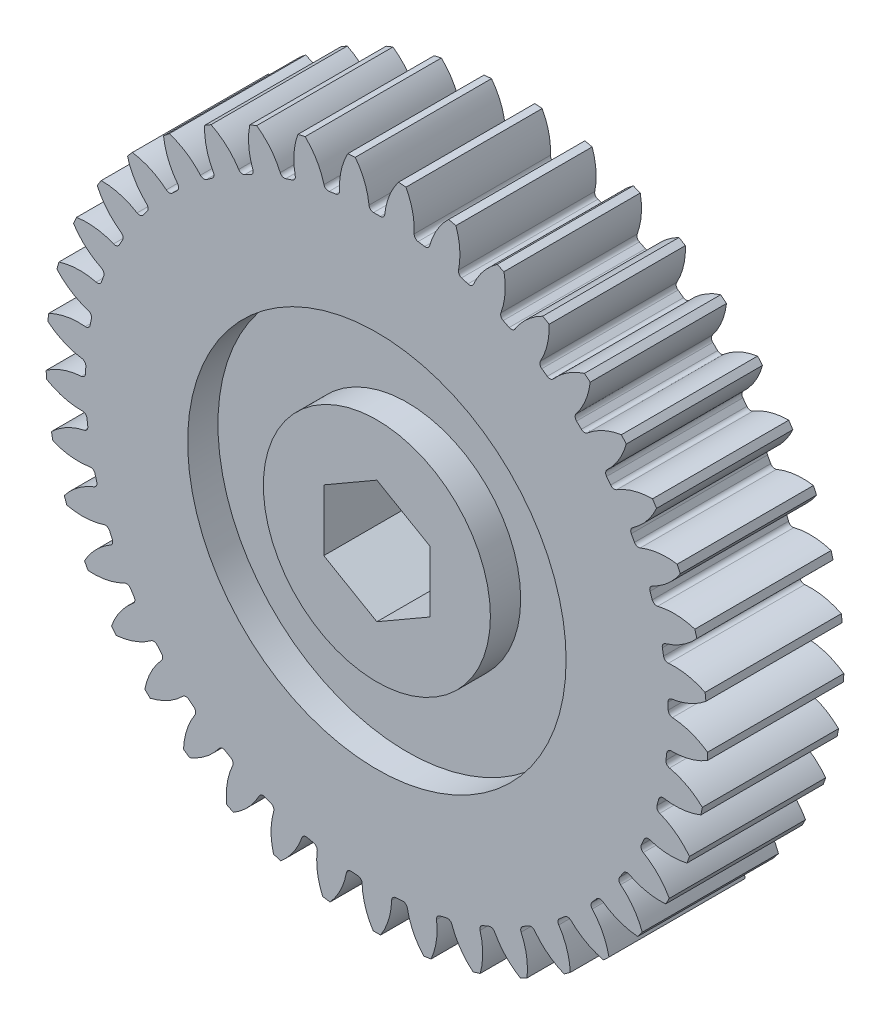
from build123d import *

# Parameters (mm, degrees)
SKIZZE1_R                       = 21.853
AUFSATZ_LINEAR_AUSTRAGEN1_DEPTH = 4.5
SKIZZE4_R                       = 12.5
SKIZZE4_R_2                     = 7.5
SCHNITT_LINEAR_AUSTRAGEN2_DEPTH = 2
SCHNITT_LINEAR_AUSTRAGEN3_DEPTH = 33.188619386
KREISMUSTER1_COUNT              = 41
SKIZZE8_R                       = 6
AUFSATZ_LINEAR_AUSTRAGEN2_DEPTH = 1
SCHNITT_LINEAR_AUSTRAGEN4_DEPTH = 33.47704342


with BuildPart() as part:
    # Skizze1 → Aufsatz-Linear austragen1 (new, symmetric)
    with BuildSketch(Plane.XY):
        Circle(SKIZZE1_R)
    extrude(amount=AUFSATZ_LINEAR_AUSTRAGEN1_DEPTH, both=True)

    # Skizze4 → Schnitt-Linear austragen2 (cut)
    with BuildSketch(Plane.XY.offset(4.5)):
        Circle(SKIZZE4_R)
        Circle(SKIZZE4_R_2, mode=Mode.SUBTRACT)
    extrude(amount=-SCHNITT_LINEAR_AUSTRAGEN2_DEPTH, mode=Mode.SUBTRACT)

    # Skizze6 → Schnitt-Linear austragen3 (cut, through all)
    with BuildSketch(Plane.XY.offset(4.5)):
        with BuildLine():
            Line((-0.221730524, 19.25), (0.221730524, 19.25))
            ThreePointArc((0.221730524, 19.25), (0.42252647, 19.327107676), (0.520103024, 19.518793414))
            ThreePointArc((0.520103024, 19.518793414), (1.015033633, 21.15853046), (2.08, 22.5))
            ThreePointArc((2.08, 22.5), (0, 22.620581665), (-2.08, 22.5))
            ThreePointArc((-2.08, 22.5), (-1.015033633, 21.15853046), (-0.520103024, 19.518793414))
            ThreePointArc((-0.520103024, 19.518793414), (-0.42252647, 19.327107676), (-0.221730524, 19.25))
        make_face()
    schnitt_linear_austragen3 = extrude(amount=-SCHNITT_LINEAR_AUSTRAGEN3_DEPTH, mode=Mode.SUBTRACT)

    # Kreismuster1: Schnitt-Linear austragen3 ×41 about axis
    kreismuster1_axis = Axis((0, 0, 0), (0, 0, 1))
    for i in range(1, KREISMUSTER1_COUNT):
        add(schnitt_linear_austragen3.rotate(kreismuster1_axis, i * 360 / KREISMUSTER1_COUNT), mode=Mode.SUBTRACT)

    # Skizze8 → Aufsatz-Linear austragen2 (add)
    with BuildSketch(Plane(origin=(0, 0, -4.5), x_dir=(-1, 0, 0), z_dir=(0, 0, -1))):
        with Locations(Location((0, 0, 0), (0, 0, 180))):
            Circle(SKIZZE8_R)
    extrude(amount=AUFSATZ_LINEAR_AUSTRAGEN2_DEPTH)

    # Skizze7 → Schnitt-Linear austragen4 (cut, through all)
    with BuildSketch(Plane.XY.offset(4.5)):
        Polygon((0, 4.05), (-3.507402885, 2.025), (-3.507402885, -2.025), (0, -4.05), (3.507402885, -2.025), (3.507402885, 2.025), align=None)
    extrude(amount=-SCHNITT_LINEAR_AUSTRAGEN4_DEPTH, mode=Mode.SUBTRACT)


solid = part.part
